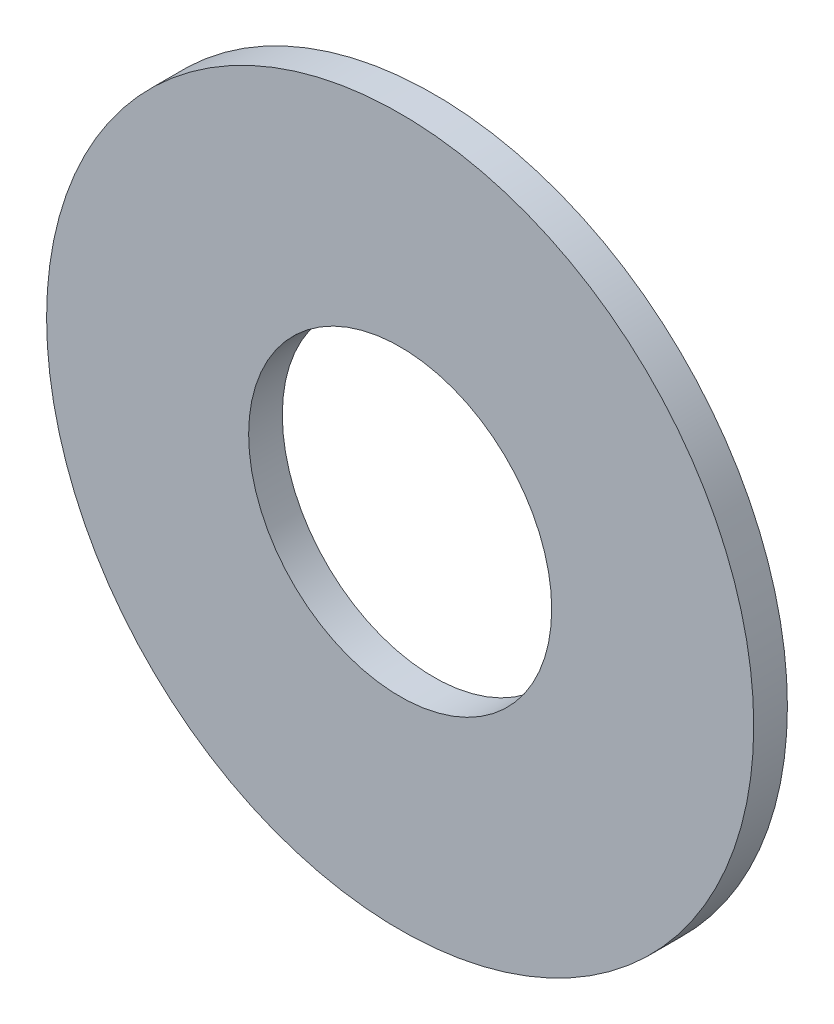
ISO-10303-21;
HEADER;
FILE_DESCRIPTION(('STEP AP214'),'2;1');
FILE_NAME('part.step','',(''),(''),'','','');
FILE_SCHEMA(('AUTOMOTIVE_DESIGN { 1 0 10303 214 1 1 1 1 }'));
ENDSEC;
DATA;
#1=APPLICATION_CONTEXT('core data for automotive mechanical design processes');
#2=APPLICATION_PROTOCOL_DEFINITION('international standard','automotive_design',2000,#1);
#3=PRODUCT_CONTEXT('',#1,'mechanical');
#4=PRODUCT('Part','Part','',(#3));
#5=PRODUCT_RELATED_PRODUCT_CATEGORY('part','',(#4));
#6=PRODUCT_DEFINITION_FORMATION('','',#4);
#7=PRODUCT_DEFINITION_CONTEXT('part definition',#1,'design');
#8=PRODUCT_DEFINITION('design','',#6,#7);
#9=PRODUCT_DEFINITION_SHAPE('','',#8);
#10=(LENGTH_UNIT() NAMED_UNIT(*) SI_UNIT(.MILLI.,.METRE.));
#11=(NAMED_UNIT(*) PLANE_ANGLE_UNIT() SI_UNIT($,.RADIAN.));
#12=(NAMED_UNIT(*) SI_UNIT($,.STERADIAN.) SOLID_ANGLE_UNIT());
#13=UNCERTAINTY_MEASURE_WITH_UNIT(LENGTH_MEASURE(1.E-05),#10,'distance_accuracy_value','');
#14=(GEOMETRIC_REPRESENTATION_CONTEXT(3) GLOBAL_UNCERTAINTY_ASSIGNED_CONTEXT((#13)) GLOBAL_UNIT_ASSIGNED_CONTEXT((#10,
#11,#12)) REPRESENTATION_CONTEXT('',''));
#15=CARTESIAN_POINT('',(0.,0.,0.));
#16=DIRECTION('',(0.,0.,1.));
#17=DIRECTION('',(1.,0.,0.));
#18=AXIS2_PLACEMENT_3D('',#15,#16,#17);
#19=CARTESIAN_POINT('',(0.,0.,1.));
#20=DIRECTION('',(0.,0.,1.));
#21=DIRECTION('',(1.,0.,0.));
#22=AXIS2_PLACEMENT_3D('',#19,#20,#21);
#23=PLANE('',#22);
#24=CARTESIAN_POINT('',(0.,0.,1.));
#25=DIRECTION('',(0.,0.,1.));
#26=DIRECTION('',(1.,0.,0.));
#27=AXIS2_PLACEMENT_3D('',#24,#25,#26);
#28=CIRCLE('',#27,10.5);
#29=CARTESIAN_POINT('',(10.5,0.,1.));
#30=VERTEX_POINT('',#29);
#31=EDGE_CURVE('E10',#30,#30,#28,.T.);
#32=ORIENTED_EDGE('',*,*,#31,.T.);
#33=EDGE_LOOP('',(#32));
#34=FACE_BOUND('',#33,.T.);
#35=CARTESIAN_POINT('',(0.,0.,1.));
#36=DIRECTION('',(0.,0.,1.));
#37=DIRECTION('',(1.,0.,0.));
#38=AXIS2_PLACEMENT_3D('',#35,#36,#37);
#39=CIRCLE('',#38,4.5);
#40=CARTESIAN_POINT('',(4.5,0.,1.));
#41=VERTEX_POINT('',#40);
#42=EDGE_CURVE('E40',#41,#41,#39,.T.);
#43=ORIENTED_EDGE('',*,*,#42,.F.);
#44=EDGE_LOOP('',(#43));
#45=FACE_BOUND('',#44,.T.);
#46=ADVANCED_FACE('F29',(#34,#45),#23,.T.);
#47=CARTESIAN_POINT('',(0.,0.,0.));
#48=DIRECTION('',(0.,0.,1.));
#49=DIRECTION('',(1.,0.,0.));
#50=AXIS2_PLACEMENT_3D('',#47,#48,#49);
#51=PLANE('',#50);
#52=CARTESIAN_POINT('',(0.,0.,0.));
#53=DIRECTION('',(0.,0.,1.));
#54=DIRECTION('',(1.,0.,0.));
#55=AXIS2_PLACEMENT_3D('',#52,#53,#54);
#56=CIRCLE('',#55,10.5);
#57=CARTESIAN_POINT('',(10.5,0.,0.));
#58=VERTEX_POINT('',#57);
#59=EDGE_CURVE('E33',#58,#58,#56,.T.);
#60=ORIENTED_EDGE('',*,*,#59,.F.);
#61=EDGE_LOOP('',(#60));
#62=FACE_BOUND('',#61,.T.);
#63=CARTESIAN_POINT('',(0.,0.,0.));
#64=DIRECTION('',(0.,0.,1.));
#65=DIRECTION('',(1.,0.,0.));
#66=AXIS2_PLACEMENT_3D('',#63,#64,#65);
#67=CIRCLE('',#66,4.5);
#68=CARTESIAN_POINT('',(4.5,0.,0.));
#69=VERTEX_POINT('',#68);
#70=EDGE_CURVE('E42',#69,#69,#67,.T.);
#71=ORIENTED_EDGE('',*,*,#70,.T.);
#72=EDGE_LOOP('',(#71));
#73=FACE_BOUND('',#72,.T.);
#74=ADVANCED_FACE('F52',(#62,#73),#51,.F.);
#75=CARTESIAN_POINT('',(0.,0.,1.));
#76=DIRECTION('',(0.,0.,-1.));
#77=DIRECTION('',(-1.,0.,0.));
#78=AXIS2_PLACEMENT_3D('',#75,#76,#77);
#79=CYLINDRICAL_SURFACE('',#78,10.5);
#80=ORIENTED_EDGE('',*,*,#31,.F.);
#81=EDGE_LOOP('',(#80));
#82=FACE_BOUND('',#81,.T.);
#83=ORIENTED_EDGE('',*,*,#59,.T.);
#84=EDGE_LOOP('',(#83));
#85=FACE_BOUND('',#84,.T.);
#86=ADVANCED_FACE('F31',(#82,#85),#79,.T.);
#87=CARTESIAN_POINT('',(0.,0.,1.));
#88=DIRECTION('',(0.,0.,-1.));
#89=DIRECTION('',(-1.,0.,0.));
#90=AXIS2_PLACEMENT_3D('',#87,#88,#89);
#91=CYLINDRICAL_SURFACE('',#90,4.5);
#92=ORIENTED_EDGE('',*,*,#42,.T.);
#93=EDGE_LOOP('',(#92));
#94=FACE_BOUND('',#93,.T.);
#95=ORIENTED_EDGE('',*,*,#70,.F.);
#96=EDGE_LOOP('',(#95));
#97=FACE_BOUND('',#96,.T.);
#98=ADVANCED_FACE('F48',(#94,#97),#91,.F.);
#99=CLOSED_SHELL('',(#46,#74,#86,#98));
#100=MANIFOLD_SOLID_BREP('B2',#99);
#101=ADVANCED_BREP_SHAPE_REPRESENTATION('',(#18,#100),#14);
#102=SHAPE_DEFINITION_REPRESENTATION(#9,#101);
ENDSEC;
END-ISO-10303-21;
